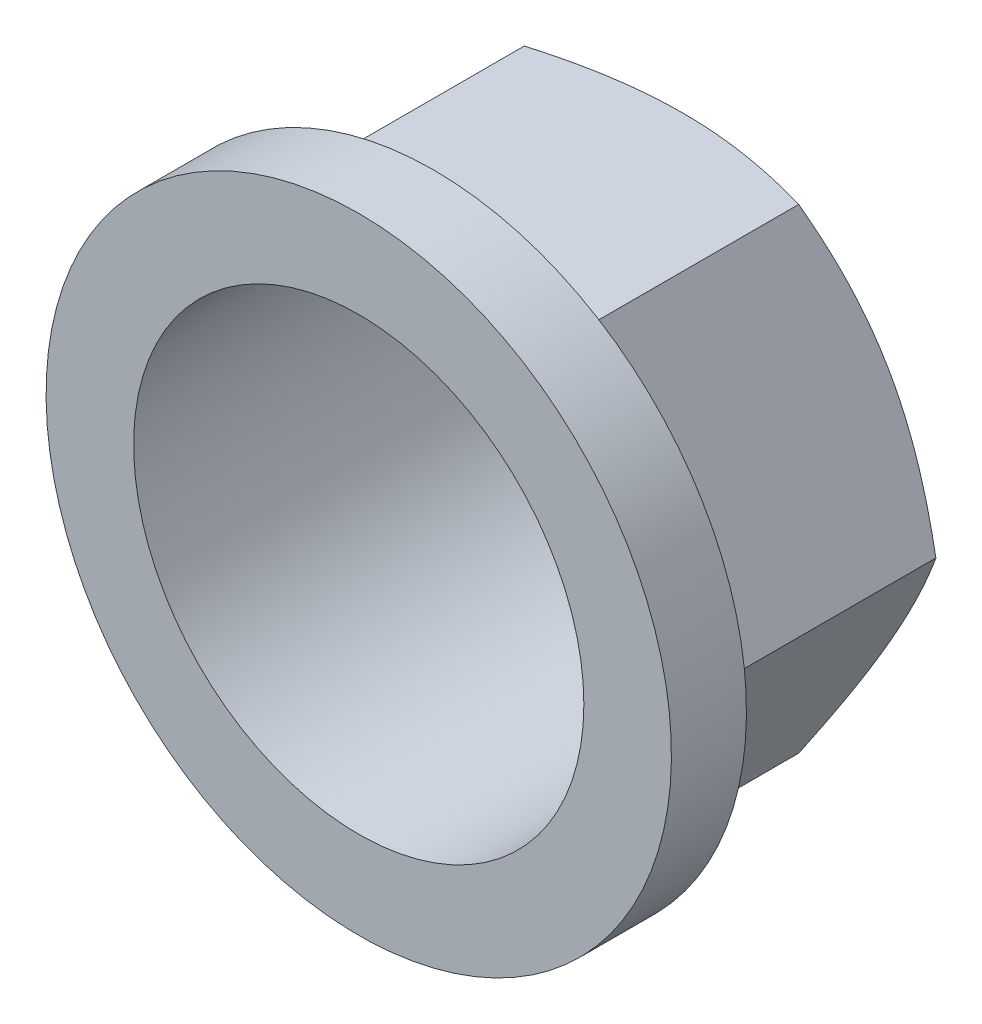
ISO-10303-21;
HEADER;
FILE_DESCRIPTION(('STEP AP214'),'2;1');
FILE_NAME('part.step','',(''),(''),'','','');
FILE_SCHEMA(('AUTOMOTIVE_DESIGN { 1 0 10303 214 1 1 1 1 }'));
ENDSEC;
DATA;
#1=APPLICATION_CONTEXT('core data for automotive mechanical design processes');
#2=APPLICATION_PROTOCOL_DEFINITION('international standard','automotive_design',2000,#1);
#3=PRODUCT_CONTEXT('',#1,'mechanical');
#4=PRODUCT('Part','Part','',(#3));
#5=PRODUCT_RELATED_PRODUCT_CATEGORY('part','',(#4));
#6=PRODUCT_DEFINITION_FORMATION('','',#4);
#7=PRODUCT_DEFINITION_CONTEXT('part definition',#1,'design');
#8=PRODUCT_DEFINITION('design','',#6,#7);
#9=PRODUCT_DEFINITION_SHAPE('','',#8);
#10=(LENGTH_UNIT() NAMED_UNIT(*) SI_UNIT(.MILLI.,.METRE.));
#11=(NAMED_UNIT(*) PLANE_ANGLE_UNIT() SI_UNIT($,.RADIAN.));
#12=(NAMED_UNIT(*) SI_UNIT($,.STERADIAN.) SOLID_ANGLE_UNIT());
#13=UNCERTAINTY_MEASURE_WITH_UNIT(LENGTH_MEASURE(1.E-05),#10,'distance_accuracy_value','');
#14=(GEOMETRIC_REPRESENTATION_CONTEXT(3) GLOBAL_UNCERTAINTY_ASSIGNED_CONTEXT((#13)) GLOBAL_UNIT_ASSIGNED_CONTEXT((#10,
#11,#12)) REPRESENTATION_CONTEXT('',''));
#15=CARTESIAN_POINT('',(0.,0.,0.));
#16=DIRECTION('',(0.,0.,1.));
#17=DIRECTION('',(1.,0.,0.));
#18=AXIS2_PLACEMENT_3D('',#15,#16,#17);
#19=CARTESIAN_POINT('',(0.,0.,4.55149422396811));
#20=DIRECTION('',(0.,0.,-1.));
#21=DIRECTION('',(0.,1.,0.));
#22=AXIS2_PLACEMENT_3D('',#19,#20,#21);
#23=PLANE('',#22);
#24=CARTESIAN_POINT('',(0.,0.,4.55149422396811));
#25=DIRECTION('',(0.,0.,-1.));
#26=DIRECTION('',(0.,1.,0.));
#27=AXIS2_PLACEMENT_3D('',#24,#25,#26);
#28=CIRCLE('',#27,12.5);
#29=CARTESIAN_POINT('',(0.,12.5,4.55149422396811));
#30=VERTEX_POINT('',#29);
#31=EDGE_CURVE('E252',#30,#30,#28,.T.);
#32=ORIENTED_EDGE('',*,*,#31,.T.);
#33=EDGE_LOOP('',(#32));
#34=FACE_BOUND('',#33,.T.);
#35=DIRECTION('',(-1.,0.,0.));
#36=VECTOR('',#35,1.);
#37=CARTESIAN_POINT('',(-5.48482755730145,-9.5,4.55149422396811));
#38=LINE('',#37,#36);
#39=CARTESIAN_POINT('',(5.48482755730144,-9.50000000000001,4.55149422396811));
#40=VERTEX_POINT('',#39);
#41=CARTESIAN_POINT('',(-5.48482755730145,-9.5,4.55149422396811));
#42=VERTEX_POINT('',#41);
#43=EDGE_CURVE('E226',#40,#42,#38,.T.);
#44=ORIENTED_EDGE('',*,*,#43,.F.);
#45=DIRECTION('',(-0.5,-0.866025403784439,0.));
#46=VECTOR('',#45,1.);
#47=CARTESIAN_POINT('',(5.48482755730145,-9.50000000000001,4.55149422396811));
#48=LINE('',#47,#46);
#49=CARTESIAN_POINT('',(10.9696551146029,0.,4.55149422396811));
#50=VERTEX_POINT('',#49);
#51=EDGE_CURVE('E263',#50,#40,#48,.T.);
#52=ORIENTED_EDGE('',*,*,#51,.F.);
#53=DIRECTION('',(0.5,-0.866025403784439,0.));
#54=VECTOR('',#53,1.);
#55=CARTESIAN_POINT('',(10.9696551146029,0.,4.55149422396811));
#56=LINE('',#55,#54);
#57=CARTESIAN_POINT('',(5.48482755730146,9.5,4.55149422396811));
#58=VERTEX_POINT('',#57);
#59=EDGE_CURVE('E114',#58,#50,#56,.T.);
#60=ORIENTED_EDGE('',*,*,#59,.F.);
#61=DIRECTION('',(1.,0.,0.));
#62=VECTOR('',#61,1.);
#63=CARTESIAN_POINT('',(5.48482755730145,9.5,4.55149422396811));
#64=LINE('',#63,#62);
#65=CARTESIAN_POINT('',(-5.48482755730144,9.50000000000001,4.55149422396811));
#66=VERTEX_POINT('',#65);
#67=EDGE_CURVE('E109',#66,#58,#64,.T.);
#68=ORIENTED_EDGE('',*,*,#67,.F.);
#69=DIRECTION('',(0.5,0.866025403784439,0.));
#70=VECTOR('',#69,1.);
#71=CARTESIAN_POINT('',(-5.48482755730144,9.5,4.55149422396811));
#72=LINE('',#71,#70);
#73=CARTESIAN_POINT('',(-10.9696551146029,0.,4.55149422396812));
#74=VERTEX_POINT('',#73);
#75=EDGE_CURVE('E111',#74,#66,#72,.T.);
#76=ORIENTED_EDGE('',*,*,#75,.F.);
#77=DIRECTION('',(-0.499999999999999,0.86602540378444,0.));
#78=VECTOR('',#77,1.);
#79=CARTESIAN_POINT('',(-10.9696551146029,0.,4.55149422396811));
#80=LINE('',#79,#78);
#81=EDGE_CURVE('E126',#42,#74,#80,.T.);
#82=ORIENTED_EDGE('',*,*,#81,.F.);
#83=EDGE_LOOP('',(#44,#52,#60,#68,#76,#82));
#84=FACE_BOUND('',#83,.T.);
#85=ADVANCED_FACE('F34',(#34,#84),#23,.T.);
#86=CARTESIAN_POINT('',(0.,0.,0.));
#87=DIRECTION('',(0.,0.,-1.));
#88=DIRECTION('',(0.,1.,0.));
#89=AXIS2_PLACEMENT_3D('',#86,#87,#88);
#90=CYLINDRICAL_SURFACE('',#89,12.5);
#91=CARTESIAN_POINT('',(0.,0.,7.55149422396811));
#92=DIRECTION('',(0.,0.,-1.));
#93=DIRECTION('',(0.,1.,0.));
#94=AXIS2_PLACEMENT_3D('',#91,#92,#93);
#95=CIRCLE('',#94,12.5);
#96=CARTESIAN_POINT('',(0.,12.5,7.55149422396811));
#97=VERTEX_POINT('',#96);
#98=EDGE_CURVE('E254',#97,#97,#95,.T.);
#99=ORIENTED_EDGE('',*,*,#98,.T.);
#100=EDGE_LOOP('',(#99));
#101=FACE_BOUND('',#100,.T.);
#102=ORIENTED_EDGE('',*,*,#31,.F.);
#103=EDGE_LOOP('',(#102));
#104=FACE_BOUND('',#103,.T.);
#105=ADVANCED_FACE('F243',(#101,#104),#90,.T.);
#106=CARTESIAN_POINT('',(0.,0.,7.55149422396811));
#107=DIRECTION('',(0.,0.,1.));
#108=DIRECTION('',(0.,-1.,0.));
#109=AXIS2_PLACEMENT_3D('',#106,#107,#108);
#110=PLANE('',#109);
#111=CARTESIAN_POINT('',(0.,0.,7.55149422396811));
#112=DIRECTION('',(0.,0.,1.));
#113=DIRECTION('',(1.,0.,0.));
#114=AXIS2_PLACEMENT_3D('',#111,#112,#113);
#115=CIRCLE('',#114,9.);
#116=CARTESIAN_POINT('',(9.,0.,7.55149422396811));
#117=VERTEX_POINT('',#116);
#118=EDGE_CURVE('E287',#117,#117,#115,.T.);
#119=ORIENTED_EDGE('',*,*,#118,.F.);
#120=EDGE_LOOP('',(#119));
#121=FACE_BOUND('',#120,.T.);
#122=ORIENTED_EDGE('',*,*,#98,.F.);
#123=EDGE_LOOP('',(#122));
#124=FACE_BOUND('',#123,.T.);
#125=ADVANCED_FACE('F248',(#121,#124),#110,.T.);
#126=CARTESIAN_POINT('',(-5.48482755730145,-9.5,5.4));
#127=DIRECTION('',(0.,1.,0.));
#128=DIRECTION('',(-1.,0.,0.));
#129=AXIS2_PLACEMENT_3D('',#126,#127,#128);
#130=PLANE('',#129);
#131=DIRECTION('',(0.,0.,-1.));
#132=VECTOR('',#131,1.);
#133=CARTESIAN_POINT('',(5.48482755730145,-9.50000000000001,5.4));
#134=LINE('',#133,#132);
#135=CARTESIAN_POINT('',(5.48482755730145,-9.50000000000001,-4.55149422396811));
#136=VERTEX_POINT('',#135);
#137=EDGE_CURVE('E140',#40,#136,#134,.T.);
#138=ORIENTED_EDGE('',*,*,#137,.F.);
#139=ORIENTED_EDGE('',*,*,#43,.T.);
#140=DIRECTION('',(0.,0.,-1.));
#141=VECTOR('',#140,1.);
#142=CARTESIAN_POINT('',(-5.48482755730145,-9.5,5.4));
#143=LINE('',#142,#141);
#144=CARTESIAN_POINT('',(-5.48482755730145,-9.5,-4.55149422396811));
#145=VERTEX_POINT('',#144);
#146=EDGE_CURVE('E136',#42,#145,#143,.T.);
#147=ORIENTED_EDGE('',*,*,#146,.T.);
#148=CARTESIAN_POINT('',(-14.8049501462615,-9.5,-0.728769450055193));
#149=CARTESIAN_POINT('',(-14.5971224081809,-9.5,-0.829754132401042));
#150=CARTESIAN_POINT('',(-14.3890526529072,-9.5,-0.930240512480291));
#151=CARTESIAN_POINT('',(-13.972378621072,-9.5,-1.13010390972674));
#152=CARTESIAN_POINT('',(-13.7637743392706,-9.5,-1.22948091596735));
#153=CARTESIAN_POINT('',(-13.137029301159,-9.5,-1.52580451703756));
#154=CARTESIAN_POINT('',(-12.7180168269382,-9.5,-1.72091422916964));
#155=CARTESIAN_POINT('',(-11.8749660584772,-9.5,-2.10610260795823));
#156=CARTESIAN_POINT('',(-11.4509128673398,-9.5,-2.29614874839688));
#157=CARTESIAN_POINT('',(-10.5994579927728,-9.5,-2.66855813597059));
#158=CARTESIAN_POINT('',(-10.1720564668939,-9.5,-2.85092174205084));
#159=CARTESIAN_POINT('',(-9.29943063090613,-9.5,-3.21163611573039));
#160=CARTESIAN_POINT('',(-8.85407465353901,-9.5,-3.38967008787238));
#161=CARTESIAN_POINT('',(-7.95818102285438,-9.5,-3.73243755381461));
#162=CARTESIAN_POINT('',(-7.50764279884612,-9.5,-3.89716956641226));
#163=CARTESIAN_POINT('',(-6.60148114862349,-9.5,-4.20906262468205));
#164=CARTESIAN_POINT('',(-6.14586985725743,-9.5,-4.35625855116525));
#165=CARTESIAN_POINT('',(-5.22812993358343,-9.5,-4.62840704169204));
#166=CARTESIAN_POINT('',(-4.76600337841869,-9.5,-4.75336652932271));
#167=CARTESIAN_POINT('',(-3.83733165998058,-9.5,-4.97445367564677));
#168=CARTESIAN_POINT('',(-3.37082333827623,-9.5,-5.07073193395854));
#169=CARTESIAN_POINT('',(-2.66675724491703,-9.5,-5.18947504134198));
#170=CARTESIAN_POINT('',(-2.43133539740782,-9.5,-5.22477853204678));
#171=CARTESIAN_POINT('',(-1.95929718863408,-9.5,-5.28613694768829));
#172=CARTESIAN_POINT('',(-1.7226809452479,-9.5,-5.31219276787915));
#173=CARTESIAN_POINT('',(-1.25169433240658,-9.5,-5.35420608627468));
#174=CARTESIAN_POINT('',(-1.0173354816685,-9.5,-5.37029219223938));
#175=CARTESIAN_POINT('',(-0.54814733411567,-9.5,-5.39253570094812));
#176=CARTESIAN_POINT('',(-0.313318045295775,-9.5,-5.39869327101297));
#177=CARTESIAN_POINT('',(0.156394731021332,-9.5,-5.40093259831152));
#178=CARTESIAN_POINT('',(0.39127821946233,-9.5,-5.39701416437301));
#179=CARTESIAN_POINT('',(0.860669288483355,-9.5,-5.37919786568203));
#180=CARTESIAN_POINT('',(1.09517685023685,-9.5,-5.36529951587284));
#181=CARTESIAN_POINT('',(1.65637532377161,-9.5,-5.32039375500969));
#182=CARTESIAN_POINT('',(1.98270598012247,-9.5,-5.28478477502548));
#183=CARTESIAN_POINT('',(2.63297891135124,-9.5,-5.19616585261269));
#184=CARTESIAN_POINT('',(2.95692086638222,-9.50000000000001,-5.14315362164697));
#185=CARTESIAN_POINT('',(3.92475322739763,-9.50000000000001,-4.96082113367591));
#186=CARTESIAN_POINT('',(4.56432034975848,-9.50000000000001,-4.80823498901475));
#187=CARTESIAN_POINT('',(5.52118771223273,-9.50000000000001,-4.54309734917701));
#188=CARTESIAN_POINT('',(5.84342968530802,-9.50000000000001,-4.44735198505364));
#189=CARTESIAN_POINT('',(6.48478280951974,-9.50000000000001,-4.24579973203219));
#190=CARTESIAN_POINT('',(6.80389393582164,-9.50000000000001,-4.13999276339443));
#191=CARTESIAN_POINT('',(7.43909000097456,-9.50000000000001,-3.9200235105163));
#192=CARTESIAN_POINT('',(7.75517580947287,-9.50000000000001,-3.80586371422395));
#193=CARTESIAN_POINT('',(8.3847172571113,-9.50000000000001,-3.57055053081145));
#194=CARTESIAN_POINT('',(8.69817296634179,-9.50000000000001,-3.44939733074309));
#195=CARTESIAN_POINT('',(9.2971233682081,-9.50000000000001,-3.21142655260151));
#196=CARTESIAN_POINT('',(9.58280159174,-9.50000000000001,-3.09506914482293));
#197=CARTESIAN_POINT('',(10.1524130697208,-9.50000000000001,-2.85815255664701));
#198=CARTESIAN_POINT('',(10.4363462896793,-9.50000000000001,-2.73759329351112));
#199=CARTESIAN_POINT('',(11.2858827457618,-9.50000000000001,-2.37053441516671));
#200=CARTESIAN_POINT('',(11.8491707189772,-9.50000000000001,-2.1186746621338));
#201=CARTESIAN_POINT('',(12.9711243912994,-9.50000000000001,-1.60430901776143));
#202=CARTESIAN_POINT('',(13.5297879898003,-9.50000000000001,-1.3417985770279));
#203=CARTESIAN_POINT('',(14.6432606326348,-9.50000000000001,-0.808812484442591));
#204=CARTESIAN_POINT('',(15.1980698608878,-9.50000000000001,-0.538337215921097));
#205=CARTESIAN_POINT('',(16.3056023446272,-9.50000000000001,0.00922009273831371));
#206=CARTESIAN_POINT('',(16.8583203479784,-9.50000000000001,0.286312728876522));
#207=CARTESIAN_POINT('',(17.9613153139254,-9.50000000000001,0.845320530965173));
#208=CARTESIAN_POINT('',(18.5115922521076,-9.50000000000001,1.12723574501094));
#209=CARTESIAN_POINT('',(19.6100286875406,-9.50000000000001,1.69482849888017));
#210=CARTESIAN_POINT('',(20.1581886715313,-9.50000000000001,1.9805050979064));
#211=CARTESIAN_POINT('',(21.2528811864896,-9.50000000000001,2.5549515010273));
#212=CARTESIAN_POINT('',(21.7994137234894,-9.50000000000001,2.84372129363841));
#213=CARTESIAN_POINT('',(23.3127333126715,-9.50000000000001,3.64777519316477));
#214=CARTESIAN_POINT('',(24.2780892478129,-9.50000000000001,4.16575214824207));
#215=CARTESIAN_POINT('',(26.2058046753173,-9.50000000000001,5.20740114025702));
#216=CARTESIAN_POINT('',(27.168163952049,-9.50000000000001,5.73107357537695));
#217=CARTESIAN_POINT('',(29.0872357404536,-9.50000000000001,6.78080177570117));
#218=CARTESIAN_POINT('',(30.0439562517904,-9.50000000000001,7.30684292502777));
#219=CARTESIAN_POINT('',(31.4776743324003,-9.50000000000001,8.09827461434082));
#220=CARTESIAN_POINT('',(31.9553330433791,-9.50000000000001,8.36246893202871));
#221=CARTESIAN_POINT('',(32.9102579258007,-9.50000000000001,8.89156487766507));
#222=CARTESIAN_POINT('',(33.3875240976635,-9.50000000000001,9.15646650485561));
#223=CARTESIAN_POINT('',(33.864618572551,-9.50000000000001,9.42167707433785));
#224=B_SPLINE_CURVE_WITH_KNOTS('',3,(#148,#149,#150,#151,#152,#153,#154,#155,#156,#157,#158,
#159,#160,#161,#162,#163,#164,#165,#166,#167,#168,#169,#170,#171,#172,#173,#174,#175,#176,#177,
#178,#179,#180,#181,#182,#183,#184,#185,#186,#187,#188,#189,#190,#191,#192,#193,#194,#195,#196,
#197,#198,#199,#200,#201,#202,#203,#204,#205,#206,#207,#208,#209,#210,#211,#212,#213,#214,#215,
#216,#217,#218,#219,#220,#221,#222,#223),.UNSPECIFIED.,.F.,.F.,(4,2,2,2,2,2,2,2,2,2,2,2,2,2,2,2,
2,2,2,2,2,2,2,2,2,2,2,2,2,2,2,2,2,2,2,2,2,4),(0.,0.693188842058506,1.38638450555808,
2.77297763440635,4.16699402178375,5.56094520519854,6.99964878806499,8.43851235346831,
9.87446433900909,11.3099684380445,12.7377964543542,13.451805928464,14.1657462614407,
14.8702739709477,15.5747898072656,16.279319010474,16.9838824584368,17.9681316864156,
18.9525103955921,20.9222567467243,21.9306662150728,22.9390836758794,23.9472019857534,
24.9552933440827,25.8806526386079,26.8060301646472,28.6569535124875,30.5086759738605,
32.3603094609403,34.2151383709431,36.0699857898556,37.9243777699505,39.7787628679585,
43.0653588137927,46.3521860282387,49.6275859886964,51.2651472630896,52.9027067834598),.UNSPECIFIED.);
#225=CARTESIAN_POINT('',(0.,-9.50000000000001,-5.4));
#226=VERTEX_POINT('',#225);
#227=EDGE_CURVE('E211',#226,#145,#224,.F.);
#228=ORIENTED_EDGE('',*,*,#227,.F.);
#229=EDGE_CURVE('E216',#136,#226,#224,.F.);
#230=ORIENTED_EDGE('',*,*,#229,.F.);
#231=EDGE_LOOP('',(#138,#139,#147,#228,#230));
#232=FACE_BOUND('',#231,.T.);
#233=ADVANCED_FACE('F36',(#232),#130,.F.);
#234=CARTESIAN_POINT('',(5.48482755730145,-9.50000000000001,5.4));
#235=DIRECTION('',(-0.866025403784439,0.5,0.));
#236=DIRECTION('',(-0.5,-0.866025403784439,0.));
#237=AXIS2_PLACEMENT_3D('',#234,#235,#236);
#238=PLANE('',#237);
#239=DIRECTION('',(0.,0.,-1.));
#240=VECTOR('',#239,1.);
#241=CARTESIAN_POINT('',(10.9696551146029,0.,5.4));
#242=LINE('',#241,#240);
#243=CARTESIAN_POINT('',(10.9696551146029,0.,-4.55149422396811));
#244=VERTEX_POINT('',#243);
#245=EDGE_CURVE('E134',#50,#244,#242,.T.);
#246=ORIENTED_EDGE('',*,*,#245,.F.);
#247=ORIENTED_EDGE('',*,*,#51,.T.);
#248=ORIENTED_EDGE('',*,*,#137,.T.);
#249=CARTESIAN_POINT('',(10.9697705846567,0.0002,-4.55142755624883));
#250=CARTESIAN_POINT('',(10.8492020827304,-0.208630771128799,-4.62102656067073));
#251=CARTESIAN_POINT('',(10.7281840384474,-0.418240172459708,-4.68746669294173));
#252=CARTESIAN_POINT('',(10.4851774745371,-0.839139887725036,-4.81315271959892));
#253=CARTESIAN_POINT('',(10.3631886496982,-1.05043073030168,-4.87239624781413));
#254=CARTESIAN_POINT('',(9.99525656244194,-1.68770779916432,-5.03818542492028));
#255=CARTESIAN_POINT('',(9.74786083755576,-2.11620976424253,-5.13248555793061));
#256=CARTESIAN_POINT('',(9.37764446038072,-2.75744333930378,-5.24306129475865));
#257=CARTESIAN_POINT('',(9.2559298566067,-2.96825921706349,-5.27456017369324));
#258=CARTESIAN_POINT('',(9.01193711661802,-3.39086703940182,-5.32738179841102));
#259=CARTESIAN_POINT('',(8.88965896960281,-3.60265900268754,-5.34870434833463));
#260=CARTESIAN_POINT('',(8.64489870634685,-4.0265962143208,-5.38062697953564));
#261=CARTESIAN_POINT('',(8.52241700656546,-4.23874074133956,-5.39123980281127));
#262=CARTESIAN_POINT('',(8.2773404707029,-4.66322575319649,-5.40151746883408));
#263=CARTESIAN_POINT('',(8.15474563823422,-4.87556623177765,-5.40118264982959));
#264=CARTESIAN_POINT('',(7.92555157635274,-5.27254199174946,-5.39032663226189));
#265=CARTESIAN_POINT('',(7.81893617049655,-5.45720529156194,-5.38112973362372));
#266=CARTESIAN_POINT('',(7.6059547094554,-5.82610000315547,-5.35463460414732));
#267=CARTESIAN_POINT('',(7.49958867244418,-6.01033138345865,-5.33733580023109));
#268=CARTESIAN_POINT('',(7.18090270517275,-6.56231167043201,-5.27369551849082));
#269=CARTESIAN_POINT('',(6.96914687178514,-6.92908353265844,-5.21561809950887));
#270=CARTESIAN_POINT('',(6.5433889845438,-7.66651782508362,-5.07042398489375));
#271=CARTESIAN_POINT('',(6.32944126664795,-8.03708614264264,-4.98269183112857));
#272=CARTESIAN_POINT('',(5.90473630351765,-8.77269671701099,-4.78357626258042));
#273=CARTESIAN_POINT('',(5.69397361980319,-9.13774839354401,-4.67223961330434));
#274=CARTESIAN_POINT('',(5.48471208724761,-9.50020000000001,-4.55142755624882));
#275=B_SPLINE_CURVE_WITH_KNOTS('',3,(#249,#250,#251,#252,#253,#254,#255,#256,#257,#258,#259,
#260,#261,#262,#263,#264,#265,#266,#267,#268,#269,#270,#271,#272,#273,#274),.UNSPECIFIED.,.F.,
.F.,(4,2,2,2,2,2,2,2,2,2,2,2,4),(0.,0.752880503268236,1.50600787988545,3.0154687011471,
3.75167336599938,4.48789219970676,5.22323407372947,5.95855322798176,6.59868084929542,
7.23885375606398,8.52010929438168,9.82978009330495,11.1368800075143),.UNSPECIFIED.);
#276=CARTESIAN_POINT('',(8.22724133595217,-4.75,-5.4));
#277=VERTEX_POINT('',#276);
#278=EDGE_CURVE('E157',#277,#136,#275,.T.);
#279=ORIENTED_EDGE('',*,*,#278,.F.);
#280=EDGE_CURVE('E160',#244,#277,#275,.T.);
#281=ORIENTED_EDGE('',*,*,#280,.F.);
#282=EDGE_LOOP('',(#246,#247,#248,#279,#281));
#283=FACE_BOUND('',#282,.T.);
#284=ADVANCED_FACE('F159',(#283),#238,.F.);
#285=CARTESIAN_POINT('',(10.9696551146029,0.,5.4));
#286=DIRECTION('',(-0.866025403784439,-0.5,0.));
#287=DIRECTION('',(0.5,-0.866025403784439,0.));
#288=AXIS2_PLACEMENT_3D('',#285,#286,#287);
#289=PLANE('',#288);
#290=DIRECTION('',(0.,0.,-1.));
#291=VECTOR('',#290,1.);
#292=CARTESIAN_POINT('',(5.48482755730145,9.5,5.4));
#293=LINE('',#292,#291);
#294=CARTESIAN_POINT('',(5.48482755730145,9.5,-4.55149422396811));
#295=VERTEX_POINT('',#294);
#296=EDGE_CURVE('E132',#58,#295,#293,.T.);
#297=ORIENTED_EDGE('',*,*,#296,.F.);
#298=ORIENTED_EDGE('',*,*,#59,.T.);
#299=ORIENTED_EDGE('',*,*,#245,.T.);
#300=CARTESIAN_POINT('',(5.48471208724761,9.5002,-4.55142755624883));
#301=CARTESIAN_POINT('',(5.6052805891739,9.2913692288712,-4.62102656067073));
#302=CARTESIAN_POINT('',(5.72629863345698,9.08175982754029,-4.68746669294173));
#303=CARTESIAN_POINT('',(5.96930519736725,8.66086011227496,-4.81315271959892));
#304=CARTESIAN_POINT('',(6.09129402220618,8.44956926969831,-4.87239624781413));
#305=CARTESIAN_POINT('',(6.4592261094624,7.81229220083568,-5.03818542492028));
#306=CARTESIAN_POINT('',(6.70662183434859,7.38379023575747,-5.13248555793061));
#307=CARTESIAN_POINT('',(7.07683821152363,6.74255666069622,-5.24306129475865));
#308=CARTESIAN_POINT('',(7.19855281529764,6.53174078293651,-5.27456017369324));
#309=CARTESIAN_POINT('',(7.44254555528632,6.10913296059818,-5.32738179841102));
#310=CARTESIAN_POINT('',(7.56482370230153,5.89734099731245,-5.34870434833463));
#311=CARTESIAN_POINT('',(7.80958396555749,5.4734037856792,-5.38062697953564));
#312=CARTESIAN_POINT('',(7.93206566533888,5.26125925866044,-5.39123980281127));
#313=CARTESIAN_POINT('',(8.17714220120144,4.83677424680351,-5.40151746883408));
#314=CARTESIAN_POINT('',(8.29973703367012,4.62443376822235,-5.40118264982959));
#315=CARTESIAN_POINT('',(8.52893109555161,4.22745800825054,-5.39032663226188));
#316=CARTESIAN_POINT('',(8.63554650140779,4.04279470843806,-5.38112973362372));
#317=CARTESIAN_POINT('',(8.84852796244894,3.67389999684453,-5.35463460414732));
#318=CARTESIAN_POINT('',(8.95489399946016,3.48966861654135,-5.33733580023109));
#319=CARTESIAN_POINT('',(9.27357996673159,2.93768832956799,-5.27369551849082));
#320=CARTESIAN_POINT('',(9.4853358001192,2.57091646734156,-5.21561809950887));
#321=CARTESIAN_POINT('',(9.91109368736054,1.83348217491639,-5.07042398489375));
#322=CARTESIAN_POINT('',(10.1250414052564,1.46291385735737,-4.98269183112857));
#323=CARTESIAN_POINT('',(10.5497463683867,0.727303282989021,-4.78357626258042));
#324=CARTESIAN_POINT('',(10.7605090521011,0.362251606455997,-4.67223961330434));
#325=CARTESIAN_POINT('',(10.9697705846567,-0.000199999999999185,-4.55142755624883));
#326=B_SPLINE_CURVE_WITH_KNOTS('',3,(#300,#301,#302,#303,#304,#305,#306,#307,#308,#309,#310,
#311,#312,#313,#314,#315,#316,#317,#318,#319,#320,#321,#322,#323,#324,#325),.UNSPECIFIED.,.F.,
.F.,(4,2,2,2,2,2,2,2,2,2,2,2,4),(0.,0.752880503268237,1.50600787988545,3.0154687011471,
3.75167336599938,4.48789219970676,5.22323407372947,5.95855322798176,6.59868084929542,
7.23885375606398,8.52010929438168,9.82978009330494,11.1368800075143),.UNSPECIFIED.);
#327=CARTESIAN_POINT('',(8.22724133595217,4.75,-5.4));
#328=VERTEX_POINT('',#327);
#329=EDGE_CURVE('E177',#328,#244,#326,.T.);
#330=ORIENTED_EDGE('',*,*,#329,.F.);
#331=EDGE_CURVE('E225',#295,#328,#326,.T.);
#332=ORIENTED_EDGE('',*,*,#331,.F.);
#333=EDGE_LOOP('',(#297,#298,#299,#330,#332));
#334=FACE_BOUND('',#333,.T.);
#335=ADVANCED_FACE('F266',(#334),#289,.F.);
#336=CARTESIAN_POINT('',(5.48482755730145,9.5,5.4));
#337=DIRECTION('',(0.,-1.,0.));
#338=DIRECTION('',(1.,0.,0.));
#339=AXIS2_PLACEMENT_3D('',#336,#337,#338);
#340=PLANE('',#339);
#341=DIRECTION('',(0.,0.,-1.));
#342=VECTOR('',#341,1.);
#343=CARTESIAN_POINT('',(-5.48482755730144,9.5,5.4));
#344=LINE('',#343,#342);
#345=CARTESIAN_POINT('',(-5.48482755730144,9.5,-4.55149422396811));
#346=VERTEX_POINT('',#345);
#347=EDGE_CURVE('E123',#66,#346,#344,.T.);
#348=ORIENTED_EDGE('',*,*,#347,.F.);
#349=ORIENTED_EDGE('',*,*,#67,.T.);
#350=ORIENTED_EDGE('',*,*,#296,.T.);
#351=CARTESIAN_POINT('',(-14.8049501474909,9.50000000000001,-0.728769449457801));
#352=CARTESIAN_POINT('',(-14.5971224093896,9.50000000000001,-0.829754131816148));
#353=CARTESIAN_POINT('',(-14.3890526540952,9.50000000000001,-0.930240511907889));
#354=CARTESIAN_POINT('',(-13.9723786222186,9.50000000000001,-1.13010390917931));
#355=CARTESIAN_POINT('',(-13.7637743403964,9.5,-1.22948091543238));
#356=CARTESIAN_POINT('',(-13.1370293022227,9.5,-1.52580451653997));
#357=CARTESIAN_POINT('',(-12.7180168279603,9.5,-1.72091422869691));
#358=CARTESIAN_POINT('',(-11.8749660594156,9.5,-2.10610260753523));
#359=CARTESIAN_POINT('',(-11.450912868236,9.5,-2.29614874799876));
#360=CARTESIAN_POINT('',(-10.5994579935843,9.5,-2.66855813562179));
#361=CARTESIAN_POINT('',(-10.1720564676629,9.5,-2.85092174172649));
#362=CARTESIAN_POINT('',(-9.29943063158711,9.5,-3.21163611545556));
#363=CARTESIAN_POINT('',(-8.85407465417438,9.5,-3.38967008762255));
#364=CARTESIAN_POINT('',(-7.95818102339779,9.5,-3.73243755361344));
#365=CARTESIAN_POINT('',(-7.50764279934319,9.5,-3.89716956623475));
#366=CARTESIAN_POINT('',(-6.60148114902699,9.5,-4.20906262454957));
#367=CARTESIAN_POINT('',(-6.14586985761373,9.5,-4.35625855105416));
#368=CARTESIAN_POINT('',(-5.22812993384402,9.5,-4.6284070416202));
#369=CARTESIAN_POINT('',(-4.76600337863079,9.5,-4.75336652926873));
#370=CARTESIAN_POINT('',(-3.8373316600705,9.5,-4.97445367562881));
#371=CARTESIAN_POINT('',(-3.37082333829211,9.5,-5.07073193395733));
#372=CARTESIAN_POINT('',(-2.66675724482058,9.5,-5.18947504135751));
#373=CARTESIAN_POINT('',(-2.43133539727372,9.5,-5.2247785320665));
#374=CARTESIAN_POINT('',(-1.95929718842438,9.5,-5.28613694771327));
#375=CARTESIAN_POINT('',(-1.72268094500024,9.5,-5.31219276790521));
#376=CARTESIAN_POINT('',(-1.25169433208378,9.5,-5.35420608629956));
#377=CARTESIAN_POINT('',(-1.01733548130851,9.5,-5.37029219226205));
#378=CARTESIAN_POINT('',(-0.548147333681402,9.5,-5.3925357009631));
#379=CARTESIAN_POINT('',(-0.313318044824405,9.5,-5.39869327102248));
#380=CARTESIAN_POINT('',(0.156394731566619,9.5,-5.40093259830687));
#381=CARTESIAN_POINT('',(0.391278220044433,9.5,-5.39701416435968));
#382=CARTESIAN_POINT('',(0.86066928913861,9.5,-5.3791978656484));
#383=CARTESIAN_POINT('',(1.09517685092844,9.5,-5.36529951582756));
#384=CARTESIAN_POINT('',(1.65637532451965,9.5,-5.32039375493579));
#385=CARTESIAN_POINT('',(1.98270598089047,9.5,-5.28478477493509));
#386=CARTESIAN_POINT('',(2.63297891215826,9.5,-5.19616585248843));
#387=CARTESIAN_POINT('',(2.95692086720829,9.5,-5.14315362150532));
#388=CARTESIAN_POINT('',(3.92475322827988,9.5,-4.96082113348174));
#389=CARTESIAN_POINT('',(4.56432035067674,9.5,-4.80823498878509));
#390=CARTESIAN_POINT('',(5.52118771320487,9.5,-4.54309734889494));
#391=CARTESIAN_POINT('',(5.84342968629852,9.5,-4.44735198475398));
#392=CARTESIAN_POINT('',(6.48478281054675,9.5,-4.24579973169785));
#393=CARTESIAN_POINT('',(6.80389393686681,9.5,-4.139992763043));
#394=CARTESIAN_POINT('',(7.4390900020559,9.5,-3.92002351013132));
#395=CARTESIAN_POINT('',(7.75517581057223,9.5,-3.80586371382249));
#396=CARTESIAN_POINT('',(8.38471725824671,9.5,-3.5705505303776));
#397=CARTESIAN_POINT('',(8.69817296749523,9.5,-3.44939733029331));
#398=CARTESIAN_POINT('',(9.2971233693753,9.5,-3.21142655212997));
#399=CARTESIAN_POINT('',(9.58280159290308,9.5,-3.09506914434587));
#400=CARTESIAN_POINT('',(10.152413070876,9.5,-2.85815255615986));
#401=CARTESIAN_POINT('',(10.4363462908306,9.5,-2.73759329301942));
#402=CARTESIAN_POINT('',(11.285882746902,9.5,-2.3705344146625));
#403=CARTESIAN_POINT('',(11.8491707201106,9.5,-2.11867466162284));
#404=CARTESIAN_POINT('',(12.9711243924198,9.5,-1.60430901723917));
#405=CARTESIAN_POINT('',(13.5297879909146,9.49999999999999,-1.3417985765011));
#406=CARTESIAN_POINT('',(14.6432606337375,9.49999999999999,-0.80881248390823));
#407=CARTESIAN_POINT('',(15.198069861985,9.49999999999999,-0.538337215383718));
#408=CARTESIAN_POINT('',(16.3056023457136,9.49999999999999,0.0092200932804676));
#409=CARTESIAN_POINT('',(16.8583203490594,9.49999999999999,0.286312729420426));
#410=CARTESIAN_POINT('',(17.9613153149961,9.49999999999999,0.845320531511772));
#411=CARTESIAN_POINT('',(18.5115922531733,9.49999999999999,1.12723574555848));
#412=CARTESIAN_POINT('',(19.6100286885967,9.49999999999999,1.69482849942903));
#413=CARTESIAN_POINT('',(20.1581886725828,9.49999999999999,1.98050509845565));
#414=CARTESIAN_POINT('',(21.252881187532,9.49999999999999,2.55495150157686));
#415=CARTESIAN_POINT('',(21.7994137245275,9.49999999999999,2.8437212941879));
#416=CARTESIAN_POINT('',(23.3127333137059,9.49999999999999,3.647775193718));
#417=CARTESIAN_POINT('',(24.2780892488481,9.49999999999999,4.16575214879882));
#418=CARTESIAN_POINT('',(26.2058046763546,9.49999999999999,5.20740114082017));
#419=CARTESIAN_POINT('',(27.1681639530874,9.49999999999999,5.73107357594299));
#420=CARTESIAN_POINT('',(29.0872357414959,9.49999999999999,6.78080177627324));
#421=CARTESIAN_POINT('',(30.0439562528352,9.49999999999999,7.30684292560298));
#422=CARTESIAN_POINT('',(31.4776743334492,9.49999999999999,8.09827461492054));
#423=CARTESIAN_POINT('',(31.9553330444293,9.49999999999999,8.36246893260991));
#424=CARTESIAN_POINT('',(32.9102579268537,9.49999999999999,8.89156487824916));
#425=CARTESIAN_POINT('',(33.3875240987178,9.49999999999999,9.15646650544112));
#426=CARTESIAN_POINT('',(33.8646185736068,9.49999999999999,9.42167707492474));
#427=B_SPLINE_CURVE_WITH_KNOTS('',3,(#351,#352,#353,#354,#355,#356,#357,#358,#359,#360,#361,
#362,#363,#364,#365,#366,#367,#368,#369,#370,#371,#372,#373,#374,#375,#376,#377,#378,#379,#380,
#381,#382,#383,#384,#385,#386,#387,#388,#389,#390,#391,#392,#393,#394,#395,#396,#397,#398,#399,
#400,#401,#402,#403,#404,#405,#406,#407,#408,#409,#410,#411,#412,#413,#414,#415,#416,#417,#418,
#419,#420,#421,#422,#423,#424,#425,#426),.UNSPECIFIED.,.F.,.F.,(4,2,2,2,2,2,2,2,2,2,2,2,2,2,2,2,
2,2,2,2,2,2,2,2,2,2,2,2,2,2,2,2,2,2,2,2,2,4),(0.,0.693188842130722,1.38638450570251,
2.77297763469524,4.16699402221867,5.56094520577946,6.99964878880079,8.43851235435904,
9.87446434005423,11.3099684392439,12.7377964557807,13.451805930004,14.1657462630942,
14.8702739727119,15.5747898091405,16.2793190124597,16.9838824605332,17.9681316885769,
18.9525103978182,20.9222567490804,21.9306662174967,22.9390836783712,23.9472019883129,
24.9552933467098,25.8806526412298,26.806030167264,28.6569535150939,30.508675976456,
32.3603094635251,34.2151383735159,36.0699857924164,37.9243777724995,39.7787628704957,
43.0653588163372,46.3521860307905,49.6275859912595,51.2651472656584,52.9027067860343),.UNSPECIFIED.);
#428=CARTESIAN_POINT('',(0.,9.50000000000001,-5.4));
#429=VERTEX_POINT('',#428);
#430=EDGE_CURVE('E164',#429,#295,#427,.T.);
#431=ORIENTED_EDGE('',*,*,#430,.F.);
#432=EDGE_CURVE('E131',#346,#429,#427,.T.);
#433=ORIENTED_EDGE('',*,*,#432,.F.);
#434=EDGE_LOOP('',(#348,#349,#350,#431,#433));
#435=FACE_BOUND('',#434,.T.);
#436=ADVANCED_FACE('F129',(#435),#340,.F.);
#437=CARTESIAN_POINT('',(-5.48482755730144,9.5,5.4));
#438=DIRECTION('',(0.866025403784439,-0.5,0.));
#439=DIRECTION('',(0.5,0.866025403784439,0.));
#440=AXIS2_PLACEMENT_3D('',#437,#438,#439);
#441=PLANE('',#440);
#442=DIRECTION('',(0.,0.,-1.));
#443=VECTOR('',#442,1.);
#444=CARTESIAN_POINT('',(-10.9696551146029,0.,5.4));
#445=LINE('',#444,#443);
#446=CARTESIAN_POINT('',(-10.9696551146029,0.,-4.55149422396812));
#447=VERTEX_POINT('',#446);
#448=EDGE_CURVE('E125',#74,#447,#445,.T.);
#449=ORIENTED_EDGE('',*,*,#448,.F.);
#450=ORIENTED_EDGE('',*,*,#75,.T.);
#451=ORIENTED_EDGE('',*,*,#347,.T.);
#452=CARTESIAN_POINT('',(-10.9697705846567,-0.000199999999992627,-4.55142755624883));
#453=CARTESIAN_POINT('',(-10.8492020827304,0.208630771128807,-4.62102656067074));
#454=CARTESIAN_POINT('',(-10.7281840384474,0.418240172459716,-4.68746669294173));
#455=CARTESIAN_POINT('',(-10.4851774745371,0.839139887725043,-4.81315271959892));
#456=CARTESIAN_POINT('',(-10.3631886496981,1.05043073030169,-4.87239624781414));
#457=CARTESIAN_POINT('',(-9.99525656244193,1.68770779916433,-5.03818542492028));
#458=CARTESIAN_POINT('',(-9.74786083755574,2.11620976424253,-5.13248555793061));
#459=CARTESIAN_POINT('',(-9.37764446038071,2.75744333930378,-5.24306129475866));
#460=CARTESIAN_POINT('',(-9.25592985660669,2.9682592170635,-5.27456017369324));
#461=CARTESIAN_POINT('',(-9.01193711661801,3.39086703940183,-5.32738179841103));
#462=CARTESIAN_POINT('',(-8.8896589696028,3.60265900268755,-5.34870434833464));
#463=CARTESIAN_POINT('',(-8.64489870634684,4.0265962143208,-5.38062697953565));
#464=CARTESIAN_POINT('',(-8.52241700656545,4.23874074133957,-5.39123980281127));
#465=CARTESIAN_POINT('',(-8.2773404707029,4.66322575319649,-5.40151746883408));
#466=CARTESIAN_POINT('',(-8.15474563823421,4.87556623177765,-5.40118264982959));
#467=CARTESIAN_POINT('',(-7.92555157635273,5.27254199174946,-5.39032663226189));
#468=CARTESIAN_POINT('',(-7.81893617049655,5.45720529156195,-5.38112973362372));
#469=CARTESIAN_POINT('',(-7.6059547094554,5.82610000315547,-5.35463460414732));
#470=CARTESIAN_POINT('',(-7.49958867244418,6.01033138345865,-5.33733580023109));
#471=CARTESIAN_POINT('',(-7.18090270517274,6.56231167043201,-5.27369551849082));
#472=CARTESIAN_POINT('',(-6.96914687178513,6.92908353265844,-5.21561809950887));
#473=CARTESIAN_POINT('',(-6.5433889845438,7.66651782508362,-5.07042398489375));
#474=CARTESIAN_POINT('',(-6.32944126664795,8.03708614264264,-4.98269183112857));
#475=CARTESIAN_POINT('',(-5.90473630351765,8.77269671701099,-4.78357626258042));
#476=CARTESIAN_POINT('',(-5.69397361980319,9.13774839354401,-4.67223961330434));
#477=CARTESIAN_POINT('',(-5.4847120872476,9.5002,-4.55142755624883));
#478=B_SPLINE_CURVE_WITH_KNOTS('',3,(#452,#453,#454,#455,#456,#457,#458,#459,#460,#461,#462,
#463,#464,#465,#466,#467,#468,#469,#470,#471,#472,#473,#474,#475,#476,#477),.UNSPECIFIED.,.F.,
.F.,(4,2,2,2,2,2,2,2,2,2,2,2,4),(0.,0.752880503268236,1.50600787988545,3.0154687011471,
3.75167336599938,4.48789219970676,5.22323407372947,5.95855322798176,6.59868084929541,
7.23885375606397,8.52010929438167,9.82978009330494,11.1368800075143),.UNSPECIFIED.);
#479=CARTESIAN_POINT('',(-8.22724133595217,4.75,-5.4));
#480=VERTEX_POINT('',#479);
#481=EDGE_CURVE('E165',#480,#346,#478,.T.);
#482=ORIENTED_EDGE('',*,*,#481,.F.);
#483=EDGE_CURVE('E205',#447,#480,#478,.T.);
#484=ORIENTED_EDGE('',*,*,#483,.F.);
#485=EDGE_LOOP('',(#449,#450,#451,#482,#484));
#486=FACE_BOUND('',#485,.T.);
#487=ADVANCED_FACE('F121',(#486),#441,.F.);
#488=CARTESIAN_POINT('',(-10.9696551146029,0.,5.4));
#489=DIRECTION('',(0.866025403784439,0.499999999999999,0.));
#490=DIRECTION('',(-0.499999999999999,0.86602540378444,0.));
#491=AXIS2_PLACEMENT_3D('',#488,#489,#490);
#492=PLANE('',#491);
#493=ORIENTED_EDGE('',*,*,#146,.F.);
#494=ORIENTED_EDGE('',*,*,#81,.T.);
#495=ORIENTED_EDGE('',*,*,#448,.T.);
#496=CARTESIAN_POINT('',(-5.48471208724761,-9.5002,-4.55142755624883));
#497=CARTESIAN_POINT('',(-5.6052805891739,-9.2913692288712,-4.62102656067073));
#498=CARTESIAN_POINT('',(-5.72629863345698,-9.08175982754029,-4.68746669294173));
#499=CARTESIAN_POINT('',(-5.96930519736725,-8.66086011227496,-4.81315271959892));
#500=CARTESIAN_POINT('',(-6.09129402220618,-8.44956926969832,-4.87239624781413));
#501=CARTESIAN_POINT('',(-6.4592261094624,-7.81229220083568,-5.03818542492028));
#502=CARTESIAN_POINT('',(-6.70662183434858,-7.38379023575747,-5.13248555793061));
#503=CARTESIAN_POINT('',(-7.07683821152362,-6.74255666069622,-5.24306129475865));
#504=CARTESIAN_POINT('',(-7.19855281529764,-6.53174078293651,-5.27456017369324));
#505=CARTESIAN_POINT('',(-7.44254555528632,-6.10913296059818,-5.32738179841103));
#506=CARTESIAN_POINT('',(-7.56482370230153,-5.89734099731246,-5.34870434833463));
#507=CARTESIAN_POINT('',(-7.80958396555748,-5.4734037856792,-5.38062697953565));
#508=CARTESIAN_POINT('',(-7.93206566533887,-5.26125925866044,-5.39123980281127));
#509=CARTESIAN_POINT('',(-8.17714220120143,-4.83677424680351,-5.40151746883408));
#510=CARTESIAN_POINT('',(-8.29973703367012,-4.62443376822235,-5.4011826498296));
#511=CARTESIAN_POINT('',(-8.5289310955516,-4.22745800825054,-5.39032663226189));
#512=CARTESIAN_POINT('',(-8.63554650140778,-4.04279470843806,-5.38112973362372));
#513=CARTESIAN_POINT('',(-8.84852796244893,-3.67389999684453,-5.35463460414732));
#514=CARTESIAN_POINT('',(-8.95489399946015,-3.48966861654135,-5.33733580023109));
#515=CARTESIAN_POINT('',(-9.27357996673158,-2.93768832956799,-5.27369551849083));
#516=CARTESIAN_POINT('',(-9.48533580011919,-2.57091646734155,-5.21561809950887));
#517=CARTESIAN_POINT('',(-9.91109368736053,-1.83348217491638,-5.07042398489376));
#518=CARTESIAN_POINT('',(-10.1250414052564,-1.46291385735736,-4.98269183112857));
#519=CARTESIAN_POINT('',(-10.5497463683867,-0.727303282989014,-4.78357626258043));
#520=CARTESIAN_POINT('',(-10.7605090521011,-0.362251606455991,-4.67223961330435));
#521=CARTESIAN_POINT('',(-10.9697705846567,0.000200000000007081,-4.55142755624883));
#522=B_SPLINE_CURVE_WITH_KNOTS('',3,(#496,#497,#498,#499,#500,#501,#502,#503,#504,#505,#506,
#507,#508,#509,#510,#511,#512,#513,#514,#515,#516,#517,#518,#519,#520,#521),.UNSPECIFIED.,.F.,
.F.,(4,2,2,2,2,2,2,2,2,2,2,2,4),(0.,0.752880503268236,1.50600787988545,3.0154687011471,
3.75167336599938,4.48789219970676,5.22323407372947,5.95855322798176,6.59868084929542,
7.23885375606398,8.52010929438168,9.82978009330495,11.1368800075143),.UNSPECIFIED.);
#523=CARTESIAN_POINT('',(-8.22724133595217,-4.74999999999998,-5.4));
#524=VERTEX_POINT('',#523);
#525=EDGE_CURVE('E197',#524,#447,#522,.T.);
#526=ORIENTED_EDGE('',*,*,#525,.F.);
#527=EDGE_CURVE('E220',#145,#524,#522,.T.);
#528=ORIENTED_EDGE('',*,*,#527,.F.);
#529=EDGE_LOOP('',(#493,#494,#495,#526,#528));
#530=FACE_BOUND('',#529,.T.);
#531=ADVANCED_FACE('F231',(#530),#492,.F.);
#532=CARTESIAN_POINT('',(-5.48482755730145,-9.5,-5.4));
#533=DIRECTION('',(0.,0.,-1.));
#534=DIRECTION('',(-1.,0.,0.));
#535=AXIS2_PLACEMENT_3D('',#532,#533,#534);
#536=PLANE('',#535);
#537=CARTESIAN_POINT('',(0.,0.,-5.40000000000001));
#538=DIRECTION('',(0.,0.,1.));
#539=DIRECTION('',(1.,0.,0.));
#540=AXIS2_PLACEMENT_3D('',#537,#538,#539);
#541=CIRCLE('',#540,9.);
#542=CARTESIAN_POINT('',(9.,0.,-5.40000000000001));
#543=VERTEX_POINT('',#542);
#544=EDGE_CURVE('E258',#543,#543,#541,.T.);
#545=ORIENTED_EDGE('',*,*,#544,.T.);
#546=EDGE_LOOP('',(#545));
#547=FACE_BOUND('',#546,.T.);
#548=CARTESIAN_POINT('',(0.,0.,-5.4));
#549=DIRECTION('',(0.,0.,-1.));
#550=DIRECTION('',(-1.,0.,0.));
#551=AXIS2_PLACEMENT_3D('',#548,#549,#550);
#552=CIRCLE('',#551,9.50000000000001);
#553=EDGE_CURVE('E39',#524,#480,#552,.T.);
#554=ORIENTED_EDGE('',*,*,#553,.T.);
#555=CARTESIAN_POINT('',(0.,0.,-5.4));
#556=DIRECTION('',(0.,0.,-1.));
#557=DIRECTION('',(-1.,0.,0.));
#558=AXIS2_PLACEMENT_3D('',#555,#556,#557);
#559=CIRCLE('',#558,9.50000000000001);
#560=EDGE_CURVE('E51',#480,#429,#559,.T.);
#561=ORIENTED_EDGE('',*,*,#560,.T.);
#562=EDGE_CURVE('E11',#429,#328,#552,.T.);
#563=ORIENTED_EDGE('',*,*,#562,.T.);
#564=EDGE_CURVE('E44',#328,#277,#552,.T.);
#565=ORIENTED_EDGE('',*,*,#564,.T.);
#566=EDGE_CURVE('E146',#277,#226,#552,.T.);
#567=ORIENTED_EDGE('',*,*,#566,.T.);
#568=EDGE_CURVE('E59',#226,#524,#552,.T.);
#569=ORIENTED_EDGE('',*,*,#568,.T.);
#570=EDGE_LOOP('',(#554,#561,#563,#565,#567,#569));
#571=FACE_BOUND('',#570,.T.);
#572=ADVANCED_FACE('F151',(#547,#571),#536,.T.);
#573=CARTESIAN_POINT('',(0.,0.,-5.4));
#574=DIRECTION('',(0.,0.,1.));
#575=DIRECTION('',(1.,0.,0.));
#576=AXIS2_PLACEMENT_3D('',#573,#574,#575);
#577=CONICAL_SURFACE('',#576,9.50000000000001,1.0471975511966);
#578=ORIENTED_EDGE('',*,*,#483,.T.);
#579=ORIENTED_EDGE('',*,*,#553,.F.);
#580=ORIENTED_EDGE('',*,*,#525,.T.);
#581=EDGE_LOOP('',(#578,#579,#580));
#582=FACE_BOUND('',#581,.T.);
#583=ADVANCED_FACE('F191',(#582),#577,.T.);
#584=ORIENTED_EDGE('',*,*,#227,.T.);
#585=ORIENTED_EDGE('',*,*,#527,.T.);
#586=ORIENTED_EDGE('',*,*,#568,.F.);
#587=EDGE_LOOP('',(#584,#585,#586));
#588=FACE_BOUND('',#587,.T.);
#589=ADVANCED_FACE('F233',(#588),#577,.T.);
#590=ORIENTED_EDGE('',*,*,#278,.T.);
#591=ORIENTED_EDGE('',*,*,#229,.T.);
#592=ORIENTED_EDGE('',*,*,#566,.F.);
#593=EDGE_LOOP('',(#590,#591,#592));
#594=FACE_BOUND('',#593,.T.);
#595=ADVANCED_FACE('F235',(#594),#577,.T.);
#596=ORIENTED_EDGE('',*,*,#329,.T.);
#597=ORIENTED_EDGE('',*,*,#280,.T.);
#598=ORIENTED_EDGE('',*,*,#564,.F.);
#599=EDGE_LOOP('',(#596,#597,#598));
#600=FACE_BOUND('',#599,.T.);
#601=ADVANCED_FACE('F189',(#600),#577,.T.);
#602=ORIENTED_EDGE('',*,*,#331,.T.);
#603=ORIENTED_EDGE('',*,*,#562,.F.);
#604=ORIENTED_EDGE('',*,*,#430,.T.);
#605=EDGE_LOOP('',(#602,#603,#604));
#606=FACE_BOUND('',#605,.T.);
#607=ADVANCED_FACE('F183',(#606),#577,.T.);
#608=ORIENTED_EDGE('',*,*,#432,.T.);
#609=ORIENTED_EDGE('',*,*,#560,.F.);
#610=ORIENTED_EDGE('',*,*,#481,.T.);
#611=EDGE_LOOP('',(#608,#609,#610));
#612=FACE_BOUND('',#611,.T.);
#613=ADVANCED_FACE('F188',(#612),#577,.T.);
#614=CARTESIAN_POINT('',(0.,0.,-5.40000000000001));
#615=DIRECTION('',(0.,0.,1.));
#616=DIRECTION('',(1.,0.,0.));
#617=AXIS2_PLACEMENT_3D('',#614,#615,#616);
#618=CYLINDRICAL_SURFACE('',#617,9.);
#619=ORIENTED_EDGE('',*,*,#544,.F.);
#620=EDGE_LOOP('',(#619));
#621=FACE_BOUND('',#620,.T.);
#622=ORIENTED_EDGE('',*,*,#118,.T.);
#623=EDGE_LOOP('',(#622));
#624=FACE_BOUND('',#623,.T.);
#625=ADVANCED_FACE('F241',(#621,#624),#618,.F.);
#626=CLOSED_SHELL('',(#85,#105,#125,#233,#284,#335,#436,#487,#531,#572,#583,#589,#595,#601,#607,
#613,#625));
#627=MANIFOLD_SOLID_BREP('B2',#626);
#628=ADVANCED_BREP_SHAPE_REPRESENTATION('',(#18,#627),#14);
#629=SHAPE_DEFINITION_REPRESENTATION(#9,#628);
ENDSEC;
END-ISO-10303-21;
